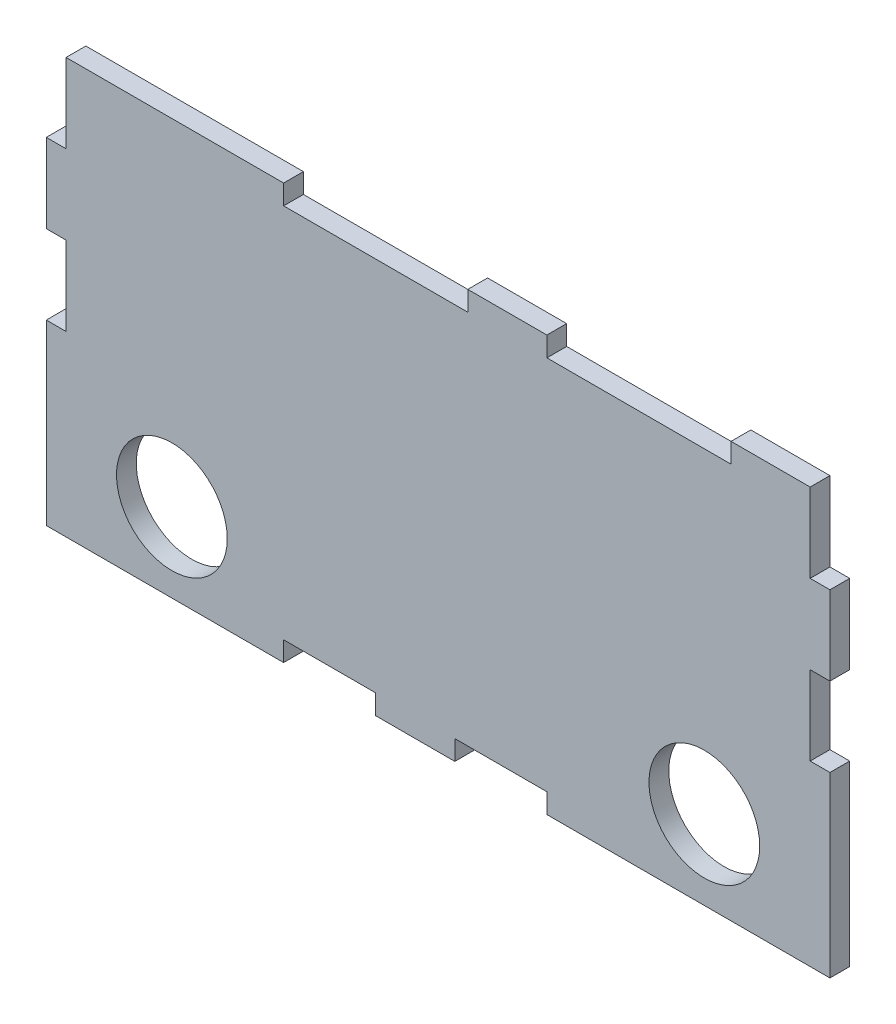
from build123d import *

# Parameters (mm, degrees)
SKETCH1_R           = 14
BOSS_EXTRUDE1_DEPTH = 5


with BuildPart() as part:
    # Sketch1 → Boss-Extrude1 (new body)
    with BuildSketch(Plane.XY):
        Polygon((0, 0), (0, 45), (5, 45), (5, 65), (0, 65), (0, 85), (5, 85), (5, 105), (60, 105), (60, 100), (106.56, 100), (106.56, 105), (126.56, 105), (126.56, 100), (173.12, 100), (173.12, 105), (193.12, 105), (193.12, 85), (198.12, 85), (198.12, 65), (193.12, 65), (193.12, 45), (198.12, 45), (198.12, 0), (126.56, 0), (126.56, 5), (103.28, 5), (103.28, 0), (83.28, 0), (83.28, 5), (60, 5), (60, 0), align=None)
        with Locations((31.75, 20)):
            Circle(SKETCH1_R, mode=Mode.SUBTRACT)
        with Locations((166.37, 20)):
            Circle(SKETCH1_R, mode=Mode.SUBTRACT)
    extrude(amount=BOSS_EXTRUDE1_DEPTH)


solid = part.part
